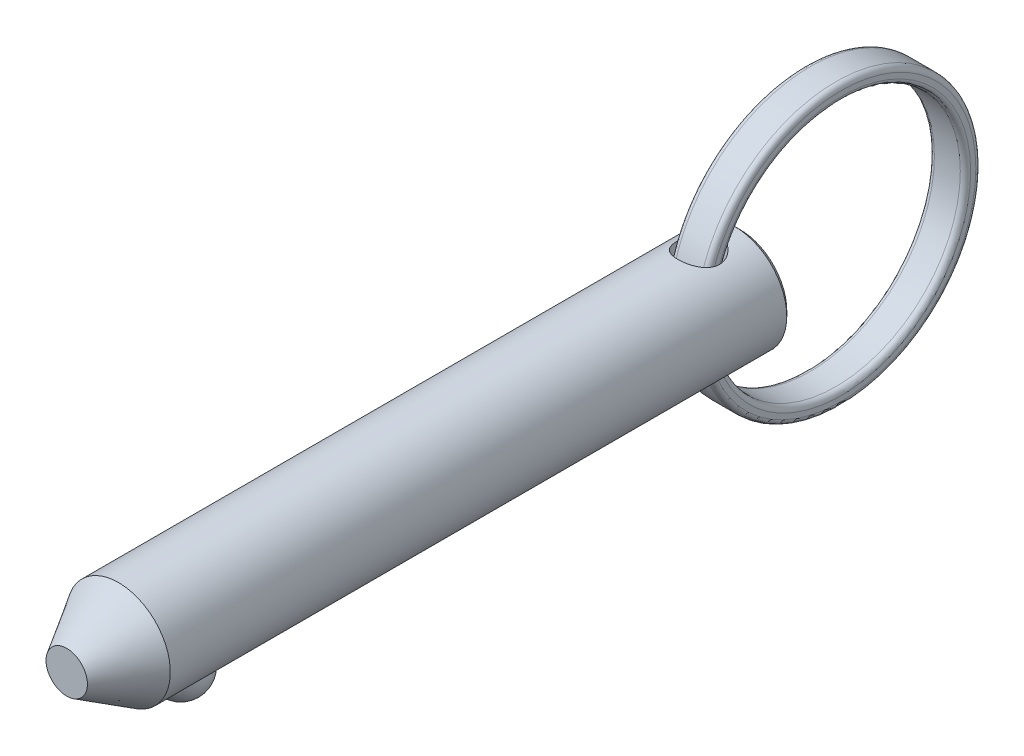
ISO-10303-21;
HEADER;
FILE_DESCRIPTION(('STEP AP214'),'2;1');
FILE_NAME('part.step','',(''),(''),'','','');
FILE_SCHEMA(('AUTOMOTIVE_DESIGN { 1 0 10303 214 1 1 1 1 }'));
ENDSEC;
DATA;
#1=APPLICATION_CONTEXT('core data for automotive mechanical design processes');
#2=APPLICATION_PROTOCOL_DEFINITION('international standard','automotive_design',2000,#1);
#3=PRODUCT_CONTEXT('',#1,'mechanical');
#4=PRODUCT('Part','Part','',(#3));
#5=PRODUCT_RELATED_PRODUCT_CATEGORY('part','',(#4));
#6=PRODUCT_DEFINITION_FORMATION('','',#4);
#7=PRODUCT_DEFINITION_CONTEXT('part definition',#1,'design');
#8=PRODUCT_DEFINITION('design','',#6,#7);
#9=PRODUCT_DEFINITION_SHAPE('','',#8);
#10=(LENGTH_UNIT() NAMED_UNIT(*) SI_UNIT(.MILLI.,.METRE.));
#11=(NAMED_UNIT(*) PLANE_ANGLE_UNIT() SI_UNIT($,.RADIAN.));
#12=(NAMED_UNIT(*) SI_UNIT($,.STERADIAN.) SOLID_ANGLE_UNIT());
#13=UNCERTAINTY_MEASURE_WITH_UNIT(LENGTH_MEASURE(1.E-05),#10,'distance_accuracy_value','');
#14=(GEOMETRIC_REPRESENTATION_CONTEXT(3) GLOBAL_UNCERTAINTY_ASSIGNED_CONTEXT((#13)) GLOBAL_UNIT_ASSIGNED_CONTEXT((#10,
#11,#12)) REPRESENTATION_CONTEXT('',''));
#15=CARTESIAN_POINT('',(0.,0.,0.));
#16=DIRECTION('',(0.,0.,1.));
#17=DIRECTION('',(1.,0.,0.));
#18=AXIS2_PLACEMENT_3D('',#15,#16,#17);
#19=CARTESIAN_POINT('',(0.,-5.,54.));
#20=DIRECTION('',(0.,0.,1.));
#21=DIRECTION('',(0.,1.,0.));
#22=AXIS2_PLACEMENT_3D('',#19,#20,#21);
#23=SPHERICAL_SURFACE('',#22,2.45);
#24=CARTESIAN_POINT('',(0.,-5.,56.45));
#25=VERTEX_POINT('',#24);
#26=VERTEX_LOOP('',#25);
#27=FACE_BOUND('',#26,.T.);
#28=ADVANCED_FACE('F41',(#27),#23,.T.);
#29=CLOSED_SHELL('',(#28));
#30=MANIFOLD_SOLID_BREP('B2',#29);
#31=CARTESIAN_POINT('',(0.,-32.5,4.));
#32=DIRECTION('',(0.,1.,0.));
#33=DIRECTION('',(0.,0.,1.));
#34=AXIS2_PLACEMENT_3D('',#31,#32,#33);
#35=CYLINDRICAL_SURFACE('',#34,2.);
#36=DIRECTION('',(0.,1.,0.));
#37=VECTOR('',#36,1.);
#38=CARTESIAN_POINT('',(1.75,-32.5,4.96824583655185));
#39=LINE('',#38,#37);
#40=CARTESIAN_POINT('',(1.75,-0.908074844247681,4.96824583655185));
#41=VERTEX_POINT('',#40);
#42=CARTESIAN_POINT('',(1.75,0.908074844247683,4.96824583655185));
#43=VERTEX_POINT('',#42);
#44=EDGE_CURVE('E100',#41,#43,#39,.T.);
#45=ORIENTED_EDGE('',*,*,#44,.T.);
#46=CARTESIAN_POINT('',(1.75,0.908074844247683,4.96824583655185));
#47=CARTESIAN_POINT('',(1.74999969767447,0.948151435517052,4.96824645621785));
#48=CARTESIAN_POINT('',(1.74997700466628,0.988227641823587,4.96828745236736));
#49=CARTESIAN_POINT('',(1.74985733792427,1.06838822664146,4.96850359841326));
#50=CARTESIAN_POINT('',(1.7497603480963,1.10847260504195,4.96867877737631));
#51=CARTESIAN_POINT('',(1.74931143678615,1.22932666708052,4.96948975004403));
#52=CARTESIAN_POINT('',(1.74880068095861,1.31009596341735,4.97041259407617));
#53=CARTESIAN_POINT('',(1.7473137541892,1.43417184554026,4.97308557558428));
#54=CARTESIAN_POINT('',(1.74666293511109,1.47749432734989,4.97425417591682));
#55=CARTESIAN_POINT('',(1.74495542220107,1.56413500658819,4.9773096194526));
#56=CARTESIAN_POINT('',(1.74389849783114,1.60745318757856,4.97919687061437));
#57=CARTESIAN_POINT('',(1.7411408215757,1.69383531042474,4.98409142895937));
#58=CARTESIAN_POINT('',(1.73944257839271,1.73689958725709,4.98709437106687));
#59=CARTESIAN_POINT('',(1.73497643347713,1.82279786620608,4.99492795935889));
#60=CARTESIAN_POINT('',(1.73220990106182,1.86563209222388,4.99975626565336));
#61=CARTESIAN_POINT('',(1.7264215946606,1.92866212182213,5.00969339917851));
#62=CARTESIAN_POINT('',(1.72426483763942,1.94915729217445,5.0133774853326));
#63=CARTESIAN_POINT('',(1.71909091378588,1.98975233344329,5.02213256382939));
#64=CARTESIAN_POINT('',(1.71607515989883,2.00985279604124,5.02720127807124));
#65=CARTESIAN_POINT('',(1.71033280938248,2.03924340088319,5.03671337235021));
#66=CARTESIAN_POINT('',(1.70820558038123,2.0489475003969,5.04021852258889));
#67=CARTESIAN_POINT('',(1.70334008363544,2.06779145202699,5.04816749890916));
#68=CARTESIAN_POINT('',(1.70060473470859,2.07693374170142,5.05260683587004));
#69=CARTESIAN_POINT('',(1.69598522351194,2.08920708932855,5.06001928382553));
#70=CARTESIAN_POINT('',(1.69448744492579,2.09282737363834,5.06241299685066));
#71=CARTESIAN_POINT('',(1.69126255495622,2.09972486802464,5.06753933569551));
#72=CARTESIAN_POINT('',(1.68953513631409,2.10300160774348,5.07027241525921));
#73=CARTESIAN_POINT('',(1.68578583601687,2.10908170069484,5.0761684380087));
#74=CARTESIAN_POINT('',(1.68375972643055,2.11187674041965,5.07933750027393));
#75=CARTESIAN_POINT('',(1.67942829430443,2.11666127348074,5.08606461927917));
#76=CARTESIAN_POINT('',(1.67712418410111,2.11865411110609,5.08962098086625));
#77=CARTESIAN_POINT('',(1.67297427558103,2.12118881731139,5.09597774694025));
#78=CARTESIAN_POINT('',(1.67117967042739,2.12198026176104,5.09871266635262));
#79=CARTESIAN_POINT('',(1.66752768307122,2.12298569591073,5.10424743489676));
#80=CARTESIAN_POINT('',(1.66567028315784,2.12319952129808,5.10704730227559));
#81=CARTESIAN_POINT('',(1.66195796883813,2.12307534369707,5.11261263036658));
#82=CARTESIAN_POINT('',(1.66010308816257,2.12274008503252,5.11537819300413));
#83=CARTESIAN_POINT('',(1.65642691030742,2.12159672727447,5.1208303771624));
#84=CARTESIAN_POINT('',(1.65460563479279,2.1207883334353,5.12351694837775));
#85=CARTESIAN_POINT('',(1.64974519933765,2.11807531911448,5.13065045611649));
#86=CARTESIAN_POINT('',(1.64676014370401,2.11579991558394,5.13499190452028));
#87=CARTESIAN_POINT('',(1.64098420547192,2.11049083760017,5.14332701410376));
#88=CARTESIAN_POINT('',(1.63819405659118,2.10745447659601,5.14731937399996));
#89=CARTESIAN_POINT('',(1.62880374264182,2.09604260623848,5.16066132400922));
#90=CARTESIAN_POINT('',(1.62265697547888,2.08640017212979,5.1692228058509));
#91=CARTESIAN_POINT('',(1.61107908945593,2.06578123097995,5.18512445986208));
#92=CARTESIAN_POINT('',(1.60565261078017,2.05479687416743,5.19245678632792));
#93=CARTESIAN_POINT('',(1.59185947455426,2.02453057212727,5.21086398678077));
#94=CARTESIAN_POINT('',(1.58393790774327,2.00458915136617,5.22118429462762));
#95=CARTESIAN_POINT('',(1.5689613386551,1.96369056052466,5.24036528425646));
#96=CARTESIAN_POINT('',(1.56190858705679,1.9427309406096,5.24922219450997));
#97=CARTESIAN_POINT('',(1.54843638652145,1.90014993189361,5.26588300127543));
#98=CARTESIAN_POINT('',(1.54201816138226,1.87852736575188,5.2736848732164));
#99=CARTESIAN_POINT('',(1.52970252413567,1.83489038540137,5.28844939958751));
#100=CARTESIAN_POINT('',(1.52380447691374,1.81287648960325,5.29541308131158));
#101=CARTESIAN_POINT('',(1.50749979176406,1.74931085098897,5.31442481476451));
#102=CARTESIAN_POINT('',(1.49762022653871,1.70737562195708,5.32564340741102));
#103=CARTESIAN_POINT('',(1.47902501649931,1.62282145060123,5.34635642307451));
#104=CARTESIAN_POINT('',(1.47030992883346,1.58020219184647,5.3558500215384));
#105=CARTESIAN_POINT('',(1.44562168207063,1.45148606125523,5.38230596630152));
#106=CARTESIAN_POINT('',(1.43114111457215,1.36467697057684,5.39720318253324));
#107=CARTESIAN_POINT('',(1.40539336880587,1.18979781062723,5.4230932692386));
#108=CARTESIAN_POINT('',(1.39413522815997,1.10172490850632,5.4340751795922));
#109=CARTESIAN_POINT('',(1.37452808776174,0.925021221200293,5.45287882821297));
#110=CARTESIAN_POINT('',(1.36617603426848,0.836391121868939,5.46070388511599));
#111=CARTESIAN_POINT('',(1.35212966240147,0.658669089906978,5.47371499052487));
#112=CARTESIAN_POINT('',(1.34643729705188,0.569576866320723,5.47889910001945));
#113=CARTESIAN_POINT('',(1.33757937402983,0.391151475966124,5.48691520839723));
#114=CARTESIAN_POINT('',(1.33441416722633,0.301818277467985,5.48974688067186));
#115=CARTESIAN_POINT('',(1.33053481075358,0.122918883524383,5.4932125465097));
#116=CARTESIAN_POINT('',(1.32982446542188,0.0333525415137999,5.49384312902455));
#117=CARTESIAN_POINT('',(1.33084912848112,-0.145755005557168,5.49293038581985));
#118=CARTESIAN_POINT('',(1.33258412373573,-0.235296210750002,5.49138707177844));
#119=CARTESIAN_POINT('',(1.33853158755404,-0.413990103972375,5.48605156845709));
#120=CARTESIAN_POINT('',(1.34273739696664,-0.503143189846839,5.48226542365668));
#121=CARTESIAN_POINT('',(1.35371966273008,-0.681142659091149,5.47224288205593));
#122=CARTESIAN_POINT('',(1.36049568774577,-0.769989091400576,5.46600689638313));
#123=CARTESIAN_POINT('',(1.37677700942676,-0.947032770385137,5.45072726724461));
#124=CARTESIAN_POINT('',(1.38627742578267,-1.03523089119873,5.44168864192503));
#125=CARTESIAN_POINT('',(1.40828029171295,-1.21082019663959,5.42020708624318));
#126=CARTESIAN_POINT('',(1.42078139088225,-1.29821172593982,5.40776568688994));
#127=CARTESIAN_POINT('',(1.44206700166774,-1.42780066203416,5.38583625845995));
#128=CARTESIAN_POINT('',(1.44953381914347,-1.47050274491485,5.37803663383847));
#129=CARTESIAN_POINT('',(1.46542518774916,-1.55549399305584,5.3611263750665));
#130=CARTESIAN_POINT('',(1.47385017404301,-1.59778296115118,5.35201514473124));
#131=CARTESIAN_POINT('',(1.49177755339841,-1.68161314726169,5.3322076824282));
#132=CARTESIAN_POINT('',(1.5012764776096,-1.72315629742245,5.32151652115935));
#133=CARTESIAN_POINT('',(1.52161486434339,-1.80530471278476,5.29804984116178));
#134=CARTESIAN_POINT('',(1.53245302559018,-1.84591084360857,5.28527634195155));
#135=CARTESIAN_POINT('',(1.55192503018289,-1.91164416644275,5.26161511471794));
#136=CARTESIAN_POINT('',(1.56001770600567,-1.93725068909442,5.25161245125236));
#137=CARTESIAN_POINT('',(1.57734211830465,-1.98737059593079,5.22971246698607));
#138=CARTESIAN_POINT('',(1.58657550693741,-2.0118823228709,5.21781239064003));
#139=CARTESIAN_POINT('',(1.60186020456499,-2.04675067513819,5.19754508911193));
#140=CARTESIAN_POINT('',(1.60721492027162,-2.05809226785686,5.19035780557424));
#141=CARTESIAN_POINT('',(1.61859482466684,-2.07956555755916,5.17483805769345));
#142=CARTESIAN_POINT('',(1.62461547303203,-2.08970457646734,5.16651326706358));
#143=CARTESIAN_POINT('',(1.63331395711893,-2.10151305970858,5.15425263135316));
#144=CARTESIAN_POINT('',(1.63553788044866,-2.10431553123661,5.15110019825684));
#145=CARTESIAN_POINT('',(1.64012059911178,-2.10952960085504,5.14456125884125));
#146=CARTESIAN_POINT('',(1.64247959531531,-2.11194059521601,5.14117440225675));
#147=CARTESIAN_POINT('',(1.64736493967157,-2.11623877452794,5.13411084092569));
#148=CARTESIAN_POINT('',(1.64989295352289,-2.11811934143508,5.13043115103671));
#149=CARTESIAN_POINT('',(1.65506807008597,-2.12108002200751,5.12284038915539));
#150=CARTESIAN_POINT('',(1.6577147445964,-2.12216280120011,5.11893013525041));
#151=CARTESIAN_POINT('',(1.6622530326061,-2.1231093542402,5.11217182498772));
#152=CARTESIAN_POINT('',(1.66413426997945,-2.123240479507,5.10935501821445));
#153=CARTESIAN_POINT('',(1.66786725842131,-2.12292459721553,5.10373463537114));
#154=CARTESIAN_POINT('',(1.66971903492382,-2.12247811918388,5.1009310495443));
#155=CARTESIAN_POINT('',(1.67333773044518,-2.12100680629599,5.09542308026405));
#156=CARTESIAN_POINT('',(1.67510464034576,-2.11998190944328,5.09271870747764));
#157=CARTESIAN_POINT('',(1.67851136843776,-2.1174183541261,5.08747845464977));
#158=CARTESIAN_POINT('',(1.68015103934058,-2.11587911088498,5.08494277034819));
#159=CARTESIAN_POINT('',(1.68391525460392,-2.11168041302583,5.0790949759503));
#160=CARTESIAN_POINT('',(1.68596834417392,-2.10881958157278,5.07588263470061));
#161=CARTESIAN_POINT('',(1.68979484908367,-2.10254261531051,5.06986265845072));
#162=CARTESIAN_POINT('',(1.69156755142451,-2.09912510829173,5.06705605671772));
#163=CARTESIAN_POINT('',(1.69627720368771,-2.08888435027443,5.05956456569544));
#164=CARTESIAN_POINT('',(1.69892882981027,-2.08162778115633,5.05530176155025));
#165=CARTESIAN_POINT('',(1.70367900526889,-2.06652135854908,5.04761524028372));
#166=CARTESIAN_POINT('',(1.70577562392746,-2.05866955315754,5.04419445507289));
#167=CARTESIAN_POINT('',(1.71172442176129,-2.03369576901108,5.03443784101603));
#168=CARTESIAN_POINT('',(1.7149167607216,-2.01602938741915,5.02912185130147));
#169=CARTESIAN_POINT('',(1.72041428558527,-1.98018381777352,5.01990244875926));
#170=CARTESIAN_POINT('',(1.72271591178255,-1.96200287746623,5.01600470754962));
#171=CARTESIAN_POINT('',(1.72676732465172,-1.92524813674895,5.00910403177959));
#172=CARTESIAN_POINT('',(1.72851223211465,-1.90667230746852,5.0061090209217));
#173=CARTESIAN_POINT('',(1.73160673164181,-1.86943891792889,5.00077332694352));
#174=CARTESIAN_POINT('',(1.73295711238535,-1.85078159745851,4.99843133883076));
#175=CARTESIAN_POINT('',(1.73654596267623,-1.79542287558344,4.99218532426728));
#176=CARTESIAN_POINT('',(1.73838976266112,-1.75862216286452,4.98894480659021));
#177=CARTESIAN_POINT('',(1.74145351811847,-1.68491310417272,4.9835385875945));
#178=CARTESIAN_POINT('',(1.7426732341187,-1.64800472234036,4.9813732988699));
#179=CARTESIAN_POINT('',(1.74573789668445,-1.53709375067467,4.97591914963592));
#180=CARTESIAN_POINT('',(1.746982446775,-1.46302511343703,4.97368245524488));
#181=CARTESIAN_POINT('',(1.74872354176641,-1.31530858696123,4.97054995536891));
#182=CARTESIAN_POINT('',(1.74922451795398,-1.24166083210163,4.96964620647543));
#183=CARTESIAN_POINT('',(1.7498436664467,-1.09441559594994,4.96852866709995));
#184=CARTESIAN_POINT('',(1.74996213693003,-1.02081812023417,4.96831433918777));
#185=CARTESIAN_POINT('',(1.75002355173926,-0.870063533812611,4.968203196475));
#186=CARTESIAN_POINT('',(1.74995772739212,-0.792906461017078,4.96832224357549));
#187=CARTESIAN_POINT('',(1.74976526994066,-0.638572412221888,4.96866999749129));
#188=CARTESIAN_POINT('',(1.74963862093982,-0.561395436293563,4.96889873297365));
#189=CARTESIAN_POINT('',(1.74940525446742,-0.406767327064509,4.96932002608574));
#190=CARTESIAN_POINT('',(1.74929860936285,-0.329316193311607,4.96951245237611));
#191=CARTESIAN_POINT('',(1.74914315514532,-0.174433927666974,4.96979289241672));
#192=CARTESIAN_POINT('',(1.74909433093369,-0.0970027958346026,4.9698809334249));
#193=CARTESIAN_POINT('',(1.74909304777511,-0.0195715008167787,4.9698832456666));
#194=B_SPLINE_CURVE_WITH_KNOTS('',3,(#46,#47,#48,#49,#50,#51,#52,#53,#54,#55,#56,#57,#58,#59,
#60,#61,#62,#63,#64,#65,#66,#67,#68,#69,#70,#71,#72,#73,#74,#75,#76,#77,#78,#79,#80,#81,#82,#83,
#84,#85,#86,#87,#88,#89,#90,#91,#92,#93,#94,#95,#96,#97,#98,#99,#100,#101,#102,#103,#104,#105,
#106,#107,#108,#109,#110,#111,#112,#113,#114,#115,#116,#117,#118,#119,#120,#121,#122,#123,#124,
#125,#126,#127,#128,#129,#130,#131,#132,#133,#134,#135,#136,#137,#138,#139,#140,#141,#142,#143,
#144,#145,#146,#147,#148,#149,#150,#151,#152,#153,#154,#155,#156,#157,#158,#159,#160,#161,#162,
#163,#164,#165,#166,#167,#168,#169,#170,#171,#172,#173,#174,#175,#176,#177,#178,#179,#180,#181,
#182,#183,#184,#185,#186,#187,#188,#189,#190,#191,#192,#193),.UNSPECIFIED.,.F.,.F.,(4,2,2,2,2,2,
2,2,2,2,2,2,2,2,2,2,2,2,2,2,2,2,2,2,2,2,2,2,2,2,2,2,2,2,2,2,2,2,2,2,2,2,2,2,2,2,2,2,2,2,2,2,2,2,
2,2,2,2,2,2,2,2,2,2,2,2,2,2,2,2,2,2,2,4),(0.,0.120228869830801,0.240483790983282,
0.482797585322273,0.612823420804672,0.742923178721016,0.872519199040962,1.00194965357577,
1.06473117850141,1.12741002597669,1.15898008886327,1.1904017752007,1.20415307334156,
1.21792295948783,1.23191079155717,1.24583969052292,1.25588734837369,1.26593786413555,
1.2759383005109,1.2859449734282,1.30306147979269,1.32023928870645,1.362765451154,
1.40555349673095,1.47680144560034,1.54823024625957,1.61979422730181,1.69126958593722,
1.82474560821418,1.95828526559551,2.225830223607,2.49411834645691,2.76212369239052,
3.03032552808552,3.29856459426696,3.56721916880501,3.8358723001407,4.10380467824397,
4.3716921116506,4.63910263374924,4.90639303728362,5.03850764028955,5.17068248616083,
5.30244198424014,5.43407444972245,5.5200043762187,5.60606025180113,5.64938431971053,
5.69242935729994,5.70671707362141,5.72102661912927,5.73550751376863,5.74993980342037,
5.7600651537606,5.77018122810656,5.78029838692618,5.79042708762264,5.8046444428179,
5.81889738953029,5.84522017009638,5.87163334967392,5.92759395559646,5.98377595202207,
6.04043761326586,6.09698521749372,6.2079087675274,6.31887484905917,6.54116777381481,
6.76213056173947,6.98292105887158,7.21439271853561,7.4459249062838,7.67827918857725,
7.91057278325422),.UNSPECIFIED.);
#195=EDGE_CURVE('E39',#43,#41,#194,.T.);
#196=ORIENTED_EDGE('',*,*,#195,.T.);
#197=EDGE_LOOP('',(#45,#196));
#198=FACE_BOUND('',#197,.T.);
#199=CARTESIAN_POINT('',(0.,-5.,6.));
#200=CARTESIAN_POINT('',(0.107493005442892,-4.99999271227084,5.99999014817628));
#201=CARTESIAN_POINT('',(0.215172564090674,-4.99649294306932,5.99128224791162));
#202=CARTESIAN_POINT('',(0.427496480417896,-4.98283453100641,5.95675229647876));
#203=CARTESIAN_POINT('',(0.532131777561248,-4.97265778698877,5.93088372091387));
#204=CARTESIAN_POINT('',(0.734953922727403,-4.94674209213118,5.86312392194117));
#205=CARTESIAN_POINT('',(0.833160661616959,-4.93102136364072,5.82128515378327));
#206=CARTESIAN_POINT('',(1.02107197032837,-4.89556610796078,5.72298082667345));
#207=CARTESIAN_POINT('',(1.11077947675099,-4.87583297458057,5.66652034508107));
#208=CARTESIAN_POINT('',(1.28350100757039,-4.83330886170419,5.53776450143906));
#209=CARTESIAN_POINT('',(1.36606227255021,-4.8104229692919,5.46489334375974));
#210=CARTESIAN_POINT('',(1.51817500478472,-4.76460576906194,5.30659999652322));
#211=CARTESIAN_POINT('',(1.58772010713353,-4.74167444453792,5.22117170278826));
#212=CARTESIAN_POINT('',(1.71487456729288,-4.69722791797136,5.03557192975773));
#213=CARTESIAN_POINT('',(1.77181498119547,-4.67582115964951,4.9349135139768));
#214=CARTESIAN_POINT('',(1.86775471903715,-4.63833647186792,4.72446360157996));
#215=CARTESIAN_POINT('',(1.90676256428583,-4.62225601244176,4.61467647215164));
#216=CARTESIAN_POINT('',(1.96389882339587,-4.59826357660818,4.3942876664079));
#217=CARTESIAN_POINT('',(1.98289396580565,-4.59001420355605,4.28394876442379));
#218=CARTESIAN_POINT('',(2.00217296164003,-4.58164004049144,4.06136500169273));
#219=CARTESIAN_POINT('',(2.00246601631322,-4.58151125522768,3.94912110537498));
#220=CARTESIAN_POINT('',(1.98498936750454,-4.58910500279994,3.73424332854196));
#221=CARTESIAN_POINT('',(1.96847531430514,-4.5962817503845,3.63148428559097));
#222=CARTESIAN_POINT('',(1.91994688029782,-4.61676187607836,3.43034044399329));
#223=CARTESIAN_POINT('',(1.88792979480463,-4.63006632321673,3.33195641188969));
#224=CARTESIAN_POINT('',(1.80869473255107,-4.6615948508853,3.13998216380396));
#225=CARTESIAN_POINT('',(1.76117986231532,-4.67991379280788,3.04653076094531));
#226=CARTESIAN_POINT('',(1.65250646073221,-4.7193811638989,2.86858418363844));
#227=CARTESIAN_POINT('',(1.59134280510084,-4.74053065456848,2.78409239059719));
#228=CARTESIAN_POINT('',(1.45155059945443,-4.78526736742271,2.619590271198));
#229=CARTESIAN_POINT('',(1.37193746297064,-4.80891664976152,2.54043127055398));
#230=CARTESIAN_POINT('',(1.20031442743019,-4.85459824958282,2.39631552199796));
#231=CARTESIAN_POINT('',(1.10830206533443,-4.87663024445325,2.33136160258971));
#232=CARTESIAN_POINT('',(0.912077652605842,-4.91714681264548,2.21638255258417));
#233=CARTESIAN_POINT('',(0.807660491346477,-4.93555270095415,2.16667771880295));
#234=CARTESIAN_POINT('',(0.591023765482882,-4.96614828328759,2.08583213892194));
#235=CARTESIAN_POINT('',(0.478808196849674,-4.97834113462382,2.05468196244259));
#236=CARTESIAN_POINT('',(0.25689588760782,-4.9945613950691,2.0135517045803));
#237=CARTESIAN_POINT('',(0.147443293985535,-4.99902945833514,2.00242754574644));
#238=CARTESIAN_POINT('',(-0.0718453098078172,-5.00068478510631,1.99828689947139));
#239=CARTESIAN_POINT('',(-0.181681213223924,-4.99787393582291,2.00526571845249));
#240=CARTESIAN_POINT('',(-0.393432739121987,-4.98557567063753,2.03629175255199));
#241=CARTESIAN_POINT('',(-0.495482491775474,-4.97639391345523,2.05955798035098));
#242=CARTESIAN_POINT('',(-0.69413542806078,-4.952594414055,2.12143570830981));
#243=CARTESIAN_POINT('',(-0.790737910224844,-4.9379759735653,2.16004917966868));
#244=CARTESIAN_POINT('',(-0.979078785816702,-4.90416594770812,2.25278493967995));
#245=CARTESIAN_POINT('',(-1.07057802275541,-4.88484815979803,2.30734547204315));
#246=CARTESIAN_POINT('',(-1.24344359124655,-4.84373364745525,2.42994032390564));
#247=CARTESIAN_POINT('',(-1.32480584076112,-4.8219359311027,2.49798004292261));
#248=CARTESIAN_POINT('',(-1.48072304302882,-4.77645117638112,2.65087001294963));
#249=CARTESIAN_POINT('',(-1.55447393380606,-4.75273441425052,2.73653354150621));
#250=CARTESIAN_POINT('',(-1.68675119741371,-4.70741672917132,2.91944008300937));
#251=CARTESIAN_POINT('',(-1.74527506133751,-4.68581615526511,3.01668500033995));
#252=CARTESIAN_POINT('',(-1.84580750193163,-4.64714299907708,3.22146169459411));
#253=CARTESIAN_POINT('',(-1.88765059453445,-4.63011630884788,3.32908399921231));
#254=CARTESIAN_POINT('',(-1.9522962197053,-4.60323673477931,3.55073365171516));
#255=CARTESIAN_POINT('',(-1.97511280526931,-4.59337855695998,3.66475620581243));
#256=CARTESIAN_POINT('',(-1.9997156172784,-4.58271759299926,3.88712790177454));
#257=CARTESIAN_POINT('',(-2.00289708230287,-4.58131421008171,3.99529483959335));
#258=CARTESIAN_POINT('',(-1.99180315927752,-4.58614836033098,4.21054485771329));
#259=CARTESIAN_POINT('',(-1.97752998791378,-4.59238492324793,4.31762807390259));
#260=CARTESIAN_POINT('',(-1.93307136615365,-4.61126649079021,4.52333218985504));
#261=CARTESIAN_POINT('',(-1.90353749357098,-4.62364831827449,4.622120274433));
#262=CARTESIAN_POINT('',(-1.83000544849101,-4.65324001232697,4.81337862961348));
#263=CARTESIAN_POINT('',(-1.78600328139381,-4.67045121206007,4.90584714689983));
#264=CARTESIAN_POINT('',(-1.68187276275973,-4.70898609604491,5.08760961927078));
#265=CARTESIAN_POINT('',(-1.62096533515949,-4.73048882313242,5.17641867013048));
#266=CARTESIAN_POINT('',(-1.4858921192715,-4.77463804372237,5.34299331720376));
#267=CARTESIAN_POINT('',(-1.41172233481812,-4.79728488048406,5.42075557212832));
#268=CARTESIAN_POINT('',(-1.24650550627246,-4.84293567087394,5.56820285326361));
#269=CARTESIAN_POINT('',(-1.15467600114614,-4.86586757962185,5.63703730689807));
#270=CARTESIAN_POINT('',(-0.959900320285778,-4.90800406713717,5.75833704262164));
#271=CARTESIAN_POINT('',(-0.856949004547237,-4.92720691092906,5.81079471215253));
#272=CARTESIAN_POINT('',(-0.644738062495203,-4.95939714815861,5.89662221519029));
#273=CARTESIAN_POINT('',(-0.535631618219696,-4.97249363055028,5.93032932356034));
#274=CARTESIAN_POINT('',(-0.312876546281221,-4.99144306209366,5.97863912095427));
#275=CARTESIAN_POINT('',(-0.199243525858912,-4.99731899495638,5.9933024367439));
#276=CARTESIAN_POINT('',(-0.0569122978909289,-4.99975899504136,5.99939538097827));
#277=CARTESIAN_POINT('',(-0.0284626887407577,-5.00000192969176,6.00000260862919));
#278=CARTESIAN_POINT('',(0.,-5.,6.));
#279=B_SPLINE_CURVE_WITH_KNOTS('',3,(#199,#200,#201,#202,#203,#204,#205,#206,#207,#208,#209,
#210,#211,#212,#213,#214,#215,#216,#217,#218,#219,#220,#221,#222,#223,#224,#225,#226,#227,#228,
#229,#230,#231,#232,#233,#234,#235,#236,#237,#238,#239,#240,#241,#242,#243,#244,#245,#246,#247,
#248,#249,#250,#251,#252,#253,#254,#255,#256,#257,#258,#259,#260,#261,#262,#263,#264,#265,#266,
#267,#268,#269,#270,#271,#272,#273,#274,#275,#276,#277,#278),.UNSPECIFIED.,.T.,.F.,(4,2,2,2,2,2,
2,2,2,2,2,2,2,2,2,2,2,2,2,2,2,2,2,2,2,2,2,2,2,2,2,2,2,2,2,2,2,2,2,4),(0.,0.322402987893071,
0.645683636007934,0.967911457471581,1.29002753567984,1.62597381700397,1.96208394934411,
2.31315258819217,2.66405423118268,2.99904105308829,3.33386306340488,3.64538328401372,
3.95695787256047,4.27489126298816,4.59294421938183,4.93558349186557,5.27829092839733,
5.62776913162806,5.9770695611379,6.30569184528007,6.63422893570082,6.94800455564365,
7.26182048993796,7.58523513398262,7.90877959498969,8.25368474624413,8.59864669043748,
8.94695045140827,9.29499672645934,9.61799673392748,9.94095572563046,10.2511431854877,
10.5614163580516,10.8894546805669,11.2175920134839,11.5670042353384,11.9165786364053,
12.2596430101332,12.6016125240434,12.686980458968),.UNSPECIFIED.);
#280=CARTESIAN_POINT('',(0.,-5.,6.));
#281=VERTEX_POINT('',#280);
#282=EDGE_CURVE('E162',#281,#281,#279,.T.);
#283=ORIENTED_EDGE('',*,*,#282,.F.);
#284=EDGE_LOOP('',(#283));
#285=FACE_BOUND('',#284,.T.);
#286=CARTESIAN_POINT('',(0.,5.,6.));
#287=CARTESIAN_POINT('',(-0.107493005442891,4.99999271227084,5.99999014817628));
#288=CARTESIAN_POINT('',(-0.215172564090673,4.99649294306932,5.99128224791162));
#289=CARTESIAN_POINT('',(-0.427496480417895,4.98283453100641,5.95675229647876));
#290=CARTESIAN_POINT('',(-0.532131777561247,4.97265778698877,5.93088372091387));
#291=CARTESIAN_POINT('',(-0.734953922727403,4.94674209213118,5.86312392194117));
#292=CARTESIAN_POINT('',(-0.833160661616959,4.93102136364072,5.82128515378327));
#293=CARTESIAN_POINT('',(-1.02107197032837,4.89556610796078,5.72298082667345));
#294=CARTESIAN_POINT('',(-1.11077947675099,4.87583297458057,5.66652034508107));
#295=CARTESIAN_POINT('',(-1.28350100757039,4.83330886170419,5.53776450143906));
#296=CARTESIAN_POINT('',(-1.36606227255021,4.8104229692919,5.46489334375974));
#297=CARTESIAN_POINT('',(-1.51817500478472,4.76460576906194,5.30659999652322));
#298=CARTESIAN_POINT('',(-1.58772010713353,4.74167444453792,5.22117170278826));
#299=CARTESIAN_POINT('',(-1.71487456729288,4.69722791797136,5.03557192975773));
#300=CARTESIAN_POINT('',(-1.77181498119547,4.67582115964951,4.9349135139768));
#301=CARTESIAN_POINT('',(-1.86775471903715,4.63833647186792,4.72446360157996));
#302=CARTESIAN_POINT('',(-1.90676256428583,4.62225601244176,4.61467647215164));
#303=CARTESIAN_POINT('',(-1.96389882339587,4.59826357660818,4.3942876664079));
#304=CARTESIAN_POINT('',(-1.98289396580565,4.59001420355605,4.28394876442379));
#305=CARTESIAN_POINT('',(-2.00217296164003,4.58164004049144,4.06136500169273));
#306=CARTESIAN_POINT('',(-2.00246601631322,4.58151125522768,3.94912110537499));
#307=CARTESIAN_POINT('',(-1.98498936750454,4.58910500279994,3.73424332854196));
#308=CARTESIAN_POINT('',(-1.96847531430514,4.5962817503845,3.63148428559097));
#309=CARTESIAN_POINT('',(-1.91994688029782,4.61676187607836,3.43034044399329));
#310=CARTESIAN_POINT('',(-1.88792979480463,4.63006632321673,3.33195641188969));
#311=CARTESIAN_POINT('',(-1.80869473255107,4.6615948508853,3.13998216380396));
#312=CARTESIAN_POINT('',(-1.76117986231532,4.67991379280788,3.04653076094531));
#313=CARTESIAN_POINT('',(-1.65250646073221,4.7193811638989,2.86858418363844));
#314=CARTESIAN_POINT('',(-1.59134280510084,4.74053065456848,2.78409239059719));
#315=CARTESIAN_POINT('',(-1.45155059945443,4.78526736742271,2.619590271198));
#316=CARTESIAN_POINT('',(-1.37193746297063,4.80891664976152,2.54043127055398));
#317=CARTESIAN_POINT('',(-1.20031442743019,4.85459824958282,2.39631552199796));
#318=CARTESIAN_POINT('',(-1.10830206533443,4.87663024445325,2.33136160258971));
#319=CARTESIAN_POINT('',(-0.912077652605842,4.91714681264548,2.21638255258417));
#320=CARTESIAN_POINT('',(-0.807660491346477,4.93555270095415,2.16667771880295));
#321=CARTESIAN_POINT('',(-0.591023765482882,4.96614828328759,2.08583213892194));
#322=CARTESIAN_POINT('',(-0.478808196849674,4.97834113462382,2.05468196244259));
#323=CARTESIAN_POINT('',(-0.25689588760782,4.9945613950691,2.0135517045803));
#324=CARTESIAN_POINT('',(-0.147443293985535,4.99902945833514,2.00242754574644));
#325=CARTESIAN_POINT('',(0.0718453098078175,5.00068478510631,1.99828689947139));
#326=CARTESIAN_POINT('',(0.181681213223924,4.99787393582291,2.00526571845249));
#327=CARTESIAN_POINT('',(0.393432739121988,4.98557567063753,2.03629175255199));
#328=CARTESIAN_POINT('',(0.495482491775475,4.97639391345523,2.05955798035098));
#329=CARTESIAN_POINT('',(0.694135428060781,4.952594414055,2.12143570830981));
#330=CARTESIAN_POINT('',(0.790737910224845,4.9379759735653,2.16004917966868));
#331=CARTESIAN_POINT('',(0.979078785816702,4.90416594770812,2.25278493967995));
#332=CARTESIAN_POINT('',(1.07057802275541,4.88484815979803,2.30734547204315));
#333=CARTESIAN_POINT('',(1.24344359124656,4.84373364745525,2.42994032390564));
#334=CARTESIAN_POINT('',(1.32480584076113,4.8219359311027,2.49798004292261));
#335=CARTESIAN_POINT('',(1.48072304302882,4.77645117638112,2.65087001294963));
#336=CARTESIAN_POINT('',(1.55447393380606,4.75273441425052,2.73653354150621));
#337=CARTESIAN_POINT('',(1.68675119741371,4.70741672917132,2.91944008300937));
#338=CARTESIAN_POINT('',(1.74527506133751,4.68581615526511,3.01668500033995));
#339=CARTESIAN_POINT('',(1.84580750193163,4.64714299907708,3.22146169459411));
#340=CARTESIAN_POINT('',(1.88765059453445,4.63011630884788,3.32908399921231));
#341=CARTESIAN_POINT('',(1.9522962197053,4.60323673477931,3.55073365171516));
#342=CARTESIAN_POINT('',(1.97511280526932,4.59337855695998,3.66475620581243));
#343=CARTESIAN_POINT('',(1.9997156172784,4.58271759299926,3.88712790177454));
#344=CARTESIAN_POINT('',(2.00289708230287,4.58131421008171,3.99529483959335));
#345=CARTESIAN_POINT('',(1.99180315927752,4.58614836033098,4.21054485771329));
#346=CARTESIAN_POINT('',(1.97752998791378,4.59238492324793,4.31762807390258));
#347=CARTESIAN_POINT('',(1.93307136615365,4.61126649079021,4.52333218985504));
#348=CARTESIAN_POINT('',(1.90353749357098,4.62364831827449,4.622120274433));
#349=CARTESIAN_POINT('',(1.83000544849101,4.65324001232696,4.81337862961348));
#350=CARTESIAN_POINT('',(1.78600328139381,4.67045121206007,4.90584714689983));
#351=CARTESIAN_POINT('',(1.68187276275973,4.70898609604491,5.08760961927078));
#352=CARTESIAN_POINT('',(1.62096533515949,4.73048882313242,5.17641867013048));
#353=CARTESIAN_POINT('',(1.4858921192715,4.77463804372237,5.34299331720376));
#354=CARTESIAN_POINT('',(1.41172233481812,4.79728488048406,5.42075557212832));
#355=CARTESIAN_POINT('',(1.24650550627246,4.84293567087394,5.56820285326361));
#356=CARTESIAN_POINT('',(1.15467600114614,4.86586757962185,5.63703730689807));
#357=CARTESIAN_POINT('',(0.959900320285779,4.90800406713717,5.75833704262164));
#358=CARTESIAN_POINT('',(0.856949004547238,4.92720691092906,5.81079471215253));
#359=CARTESIAN_POINT('',(0.644738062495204,4.95939714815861,5.89662221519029));
#360=CARTESIAN_POINT('',(0.535631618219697,4.97249363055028,5.93032932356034));
#361=CARTESIAN_POINT('',(0.312876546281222,4.99144306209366,5.97863912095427));
#362=CARTESIAN_POINT('',(0.199243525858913,4.99731899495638,5.9933024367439));
#363=CARTESIAN_POINT('',(0.0569122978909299,4.99975899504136,5.99939538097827));
#364=CARTESIAN_POINT('',(0.0284626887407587,5.00000192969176,6.00000260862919));
#365=CARTESIAN_POINT('',(0.,5.,6.));
#366=B_SPLINE_CURVE_WITH_KNOTS('',3,(#286,#287,#288,#289,#290,#291,#292,#293,#294,#295,#296,
#297,#298,#299,#300,#301,#302,#303,#304,#305,#306,#307,#308,#309,#310,#311,#312,#313,#314,#315,
#316,#317,#318,#319,#320,#321,#322,#323,#324,#325,#326,#327,#328,#329,#330,#331,#332,#333,#334,
#335,#336,#337,#338,#339,#340,#341,#342,#343,#344,#345,#346,#347,#348,#349,#350,#351,#352,#353,
#354,#355,#356,#357,#358,#359,#360,#361,#362,#363,#364,#365),.UNSPECIFIED.,.T.,.F.,(4,2,2,2,2,2,
2,2,2,2,2,2,2,2,2,2,2,2,2,2,2,2,2,2,2,2,2,2,2,2,2,2,2,2,2,2,2,2,2,4),(0.,0.322402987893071,
0.645683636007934,0.967911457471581,1.29002753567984,1.62597381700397,1.96208394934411,
2.31315258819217,2.66405423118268,2.99904105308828,3.33386306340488,3.64538328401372,
3.95695787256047,4.27489126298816,4.59294421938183,4.93558349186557,5.27829092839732,
5.62776913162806,5.9770695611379,6.30569184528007,6.63422893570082,6.94800455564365,
7.26182048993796,7.58523513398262,7.90877959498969,8.25368474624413,8.59864669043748,
8.94695045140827,9.29499672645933,9.61799673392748,9.94095572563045,10.2511431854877,
10.5614163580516,10.8894546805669,11.2175920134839,11.5670042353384,11.9165786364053,
12.2596430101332,12.6016125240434,12.6869804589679),.UNSPECIFIED.);
#367=CARTESIAN_POINT('',(0.,5.,6.));
#368=VERTEX_POINT('',#367);
#369=EDGE_CURVE('E165',#368,#368,#366,.T.);
#370=ORIENTED_EDGE('',*,*,#369,.F.);
#371=EDGE_LOOP('',(#370));
#372=FACE_BOUND('',#371,.T.);
#373=DIRECTION('',(0.,1.,0.));
#374=VECTOR('',#373,1.);
#375=CARTESIAN_POINT('',(-1.75,-32.5,4.96824583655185));
#376=LINE('',#375,#374);
#377=CARTESIAN_POINT('',(-1.75,-0.908074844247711,4.96824583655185));
#378=VERTEX_POINT('',#377);
#379=CARTESIAN_POINT('',(-1.75,0.908074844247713,4.96824583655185));
#380=VERTEX_POINT('',#379);
#381=EDGE_CURVE('E98',#378,#380,#376,.T.);
#382=ORIENTED_EDGE('',*,*,#381,.F.);
#383=CARTESIAN_POINT('',(-1.75,-0.908074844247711,4.96824583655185));
#384=CARTESIAN_POINT('',(-1.74999969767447,-0.948151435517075,4.96824645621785));
#385=CARTESIAN_POINT('',(-1.74997700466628,-0.988227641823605,4.96828745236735));
#386=CARTESIAN_POINT('',(-1.74985733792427,-1.06838822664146,4.96850359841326));
#387=CARTESIAN_POINT('',(-1.7497603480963,-1.10847260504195,4.96867877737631));
#388=CARTESIAN_POINT('',(-1.74931143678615,-1.22932666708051,4.96948975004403));
#389=CARTESIAN_POINT('',(-1.74880068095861,-1.31009596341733,4.97041259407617));
#390=CARTESIAN_POINT('',(-1.7473137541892,-1.43417184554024,4.97308557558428));
#391=CARTESIAN_POINT('',(-1.74666293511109,-1.47749432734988,4.97425417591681));
#392=CARTESIAN_POINT('',(-1.74495542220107,-1.56413500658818,4.97730961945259));
#393=CARTESIAN_POINT('',(-1.74389849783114,-1.60745318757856,4.97919687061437));
#394=CARTESIAN_POINT('',(-1.7411408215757,-1.69383531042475,4.98409142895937));
#395=CARTESIAN_POINT('',(-1.73944257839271,-1.7368995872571,4.98709437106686));
#396=CARTESIAN_POINT('',(-1.73497643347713,-1.8227978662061,4.99492795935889));
#397=CARTESIAN_POINT('',(-1.73220990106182,-1.8656320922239,4.99975626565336));
#398=CARTESIAN_POINT('',(-1.7264215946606,-1.92866212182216,5.00969339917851));
#399=CARTESIAN_POINT('',(-1.72426483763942,-1.94915729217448,5.01337748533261));
#400=CARTESIAN_POINT('',(-1.71909091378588,-1.98975233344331,5.0221325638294));
#401=CARTESIAN_POINT('',(-1.71607515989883,-2.00985279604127,5.02720127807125));
#402=CARTESIAN_POINT('',(-1.71033280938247,-2.03924340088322,5.03671337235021));
#403=CARTESIAN_POINT('',(-1.70820558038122,-2.04894750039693,5.0402185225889));
#404=CARTESIAN_POINT('',(-1.70334008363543,-2.06779145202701,5.04816749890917));
#405=CARTESIAN_POINT('',(-1.70060473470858,-2.07693374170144,5.05260683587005));
#406=CARTESIAN_POINT('',(-1.69598522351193,-2.08920708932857,5.06001928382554));
#407=CARTESIAN_POINT('',(-1.69448744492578,-2.09282737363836,5.06241299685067));
#408=CARTESIAN_POINT('',(-1.69126255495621,-2.09972486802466,5.06753933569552));
#409=CARTESIAN_POINT('',(-1.68953513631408,-2.10300160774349,5.07027241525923));
#410=CARTESIAN_POINT('',(-1.68578583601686,-2.10908170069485,5.07616843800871));
#411=CARTESIAN_POINT('',(-1.68375972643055,-2.11187674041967,5.07933750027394));
#412=CARTESIAN_POINT('',(-1.67942829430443,-2.11666127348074,5.08606461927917));
#413=CARTESIAN_POINT('',(-1.6771241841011,-2.11865411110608,5.08962098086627));
#414=CARTESIAN_POINT('',(-1.67297427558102,-2.12118881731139,5.09597774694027));
#415=CARTESIAN_POINT('',(-1.67117967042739,-2.12198026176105,5.09871266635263));
#416=CARTESIAN_POINT('',(-1.66752768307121,-2.12298569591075,5.10424743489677));
#417=CARTESIAN_POINT('',(-1.66567028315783,-2.12319952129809,5.1070473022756));
#418=CARTESIAN_POINT('',(-1.66195796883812,-2.12307534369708,5.11261263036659));
#419=CARTESIAN_POINT('',(-1.66010308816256,-2.12274008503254,5.11537819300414));
#420=CARTESIAN_POINT('',(-1.65642691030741,-2.12159672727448,5.12083037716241));
#421=CARTESIAN_POINT('',(-1.65460563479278,-2.1207883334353,5.12351694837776));
#422=CARTESIAN_POINT('',(-1.64974519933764,-2.11807531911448,5.13065045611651));
#423=CARTESIAN_POINT('',(-1.646760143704,-2.11579991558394,5.1349919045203));
#424=CARTESIAN_POINT('',(-1.64098420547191,-2.11049083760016,5.14332701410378));
#425=CARTESIAN_POINT('',(-1.63819405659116,-2.10745447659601,5.14731937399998));
#426=CARTESIAN_POINT('',(-1.6288037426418,-2.09604260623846,5.16066132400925));
#427=CARTESIAN_POINT('',(-1.62265697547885,-2.08640017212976,5.16922280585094));
#428=CARTESIAN_POINT('',(-1.6110790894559,-2.06578123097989,5.18512445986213));
#429=CARTESIAN_POINT('',(-1.60565261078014,-2.05479687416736,5.19245678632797));
#430=CARTESIAN_POINT('',(-1.59185947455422,-2.02453057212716,5.21086398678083));
#431=CARTESIAN_POINT('',(-1.58393790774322,-2.00458915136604,5.22118429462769));
#432=CARTESIAN_POINT('',(-1.56896133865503,-1.96369056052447,5.24036528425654));
#433=CARTESIAN_POINT('',(-1.56190858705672,-1.94273094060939,5.24922219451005));
#434=CARTESIAN_POINT('',(-1.54843638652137,-1.90014993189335,5.26588300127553));
#435=CARTESIAN_POINT('',(-1.54201816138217,-1.87852736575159,5.2736848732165));
#436=CARTESIAN_POINT('',(-1.52970252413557,-1.83489038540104,5.28844939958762));
#437=CARTESIAN_POINT('',(-1.52380447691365,-1.81287648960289,5.2954130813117));
#438=CARTESIAN_POINT('',(-1.50749979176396,-1.74931085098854,5.31442481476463));
#439=CARTESIAN_POINT('',(-1.4976202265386,-1.7073756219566,5.32564340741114));
#440=CARTESIAN_POINT('',(-1.47902501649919,-1.62282145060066,5.34635642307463));
#441=CARTESIAN_POINT('',(-1.47030992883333,-1.58020219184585,5.35585002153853));
#442=CARTESIAN_POINT('',(-1.4456216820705,-1.45148606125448,5.38230596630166));
#443=CARTESIAN_POINT('',(-1.43114111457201,-1.364676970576,5.39720318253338));
#444=CARTESIAN_POINT('',(-1.40539336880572,-1.1897978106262,5.42309326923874));
#445=CARTESIAN_POINT('',(-1.39413522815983,-1.10172490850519,5.43407517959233));
#446=CARTESIAN_POINT('',(-1.37452808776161,-0.925021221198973,5.45287882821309));
#447=CARTESIAN_POINT('',(-1.36617603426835,-0.836391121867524,5.4607038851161));
#448=CARTESIAN_POINT('',(-1.35212966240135,-0.658669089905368,5.47371499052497));
#449=CARTESIAN_POINT('',(-1.34643729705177,-0.569576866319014,5.47889910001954));
#450=CARTESIAN_POINT('',(-1.33757937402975,-0.39115147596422,5.4869152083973));
#451=CARTESIAN_POINT('',(-1.33441416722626,-0.301818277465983,5.48974688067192));
#452=CARTESIAN_POINT('',(-1.33053481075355,-0.122918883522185,5.49321254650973));
#453=CARTESIAN_POINT('',(-1.32982446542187,-0.0333525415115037,5.49384312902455));
#454=CARTESIAN_POINT('',(-1.33084912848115,0.145755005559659,5.49293038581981));
#455=CARTESIAN_POINT('',(-1.33258412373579,0.23529621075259,5.49138707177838));
#456=CARTESIAN_POINT('',(-1.33853158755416,0.413990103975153,5.48605156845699));
#457=CARTESIAN_POINT('',(-1.34273739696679,0.503143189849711,5.48226542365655));
#458=CARTESIAN_POINT('',(-1.3537196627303,0.681142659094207,5.47224288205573));
#459=CARTESIAN_POINT('',(-1.36049568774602,0.769989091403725,5.46600689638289));
#460=CARTESIAN_POINT('',(-1.3767770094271,0.947032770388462,5.45072726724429));
#461=CARTESIAN_POINT('',(-1.38627742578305,1.03523089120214,5.44168864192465));
#462=CARTESIAN_POINT('',(-1.40828029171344,1.21082019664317,5.42020708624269));
#463=CARTESIAN_POINT('',(-1.42078139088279,1.29821172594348,5.4077656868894));
#464=CARTESIAN_POINT('',(-1.44206700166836,1.42780066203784,5.3858362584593));
#465=CARTESIAN_POINT('',(-1.44953381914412,1.47050274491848,5.37803663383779));
#466=CARTESIAN_POINT('',(-1.46542518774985,1.55549399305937,5.36112637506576));
#467=CARTESIAN_POINT('',(-1.47385017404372,1.59778296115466,5.35201514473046));
#468=CARTESIAN_POINT('',(-1.49177755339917,1.68161314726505,5.33220768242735));
#469=CARTESIAN_POINT('',(-1.50127647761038,1.72315629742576,5.32151652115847));
#470=CARTESIAN_POINT('',(-1.52161486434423,1.80530471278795,5.2980498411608));
#471=CARTESIAN_POINT('',(-1.53245302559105,1.84591084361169,5.28527634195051));
#472=CARTESIAN_POINT('',(-1.55192503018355,1.91164416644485,5.26161511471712));
#473=CARTESIAN_POINT('',(-1.56001770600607,1.9372506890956,5.25161245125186));
#474=CARTESIAN_POINT('',(-1.57734211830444,1.98737059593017,5.22971246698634));
#475=CARTESIAN_POINT('',(-1.58657550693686,2.01188232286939,5.21781239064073));
#476=CARTESIAN_POINT('',(-1.60186020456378,2.04675067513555,5.19754508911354));
#477=CARTESIAN_POINT('',(-1.60721492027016,2.05809226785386,5.1903578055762));
#478=CARTESIAN_POINT('',(-1.61859482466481,2.07956555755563,5.17483805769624));
#479=CARTESIAN_POINT('',(-1.62461547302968,2.08970457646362,5.16651326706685));
#480=CARTESIAN_POINT('',(-1.6333139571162,2.10151305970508,5.15425263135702));
#481=CARTESIAN_POINT('',(-1.63553788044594,2.1043155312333,5.1511001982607));
#482=CARTESIAN_POINT('',(-1.64012059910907,2.10952960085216,5.14456125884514));
#483=CARTESIAN_POINT('',(-1.64247959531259,2.11194059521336,5.14117440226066));
#484=CARTESIAN_POINT('',(-1.64736493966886,2.11623877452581,5.13411084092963));
#485=CARTESIAN_POINT('',(-1.64989295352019,2.11811934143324,5.13043115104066));
#486=CARTESIAN_POINT('',(-1.65506807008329,2.12108002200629,5.12284038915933));
#487=CARTESIAN_POINT('',(-1.65771474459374,2.12216280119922,5.11893013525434));
#488=CARTESIAN_POINT('',(-1.6622530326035,2.12310935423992,5.11217182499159));
#489=CARTESIAN_POINT('',(-1.66413426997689,2.12324047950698,5.1093550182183));
#490=CARTESIAN_POINT('',(-1.66786725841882,2.12292459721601,5.1037346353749));
#491=CARTESIAN_POINT('',(-1.66971903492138,2.1224781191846,5.100931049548));
#492=CARTESIAN_POINT('',(-1.67333773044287,2.12100680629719,5.09542308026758));
#493=CARTESIAN_POINT('',(-1.67510464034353,2.11998190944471,5.09271870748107));
#494=CARTESIAN_POINT('',(-1.67851136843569,2.11741835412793,5.08747845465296));
#495=CARTESIAN_POINT('',(-1.68015103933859,2.11587911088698,5.08494277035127));
#496=CARTESIAN_POINT('',(-1.68391525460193,2.1116804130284,5.07909497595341));
#497=CARTESIAN_POINT('',(-1.68596834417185,2.10881958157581,5.07588263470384));
#498=CARTESIAN_POINT('',(-1.6897948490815,2.10254261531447,5.06986265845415));
#499=CARTESIAN_POINT('',(-1.6915675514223,2.09912510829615,5.06705605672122));
#500=CARTESIAN_POINT('',(-1.69627720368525,2.08888435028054,5.05956456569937));
#501=CARTESIAN_POINT('',(-1.69892882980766,2.08162778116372,5.05530176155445));
#502=CARTESIAN_POINT('',(-1.70367900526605,2.06652135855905,5.04761524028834));
#503=CARTESIAN_POINT('',(-1.70577562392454,2.05866955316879,5.04419445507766));
#504=CARTESIAN_POINT('',(-1.71172442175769,2.03369576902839,5.03443784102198));
#505=CARTESIAN_POINT('',(-1.71491676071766,2.01602938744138,5.02912185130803));
#506=CARTESIAN_POINT('',(-1.72041428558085,1.98018381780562,5.0199024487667));
#507=CARTESIAN_POINT('',(-1.722715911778,1.96200287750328,5.01600470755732));
#508=CARTESIAN_POINT('',(-1.72676732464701,1.92524813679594,5.00910403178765));
#509=CARTESIAN_POINT('',(-1.72851223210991,1.9066723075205,5.00610902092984));
#510=CARTESIAN_POINT('',(-1.73160673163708,1.86943891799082,5.00077332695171));
#511=CARTESIAN_POINT('',(-1.73295711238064,1.8507815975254,4.99843133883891));
#512=CARTESIAN_POINT('',(-1.73654596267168,1.79542287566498,4.99218532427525));
#513=CARTESIAN_POINT('',(-1.73838976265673,1.75862216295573,4.98894480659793));
#514=CARTESIAN_POINT('',(-1.74145351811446,1.68491310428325,4.98353858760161));
#515=CARTESIAN_POINT('',(-1.7426732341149,1.64800472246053,4.98137329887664));
#516=CARTESIAN_POINT('',(-1.74573789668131,1.53709375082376,4.97591914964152));
#517=CARTESIAN_POINT('',(-1.74698244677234,1.46302511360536,4.97368245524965));
#518=CARTESIAN_POINT('',(-1.74872354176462,1.31530858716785,4.97054995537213));
#519=CARTESIAN_POINT('',(-1.7492245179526,1.24166083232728,4.96964620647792));
#520=CARTESIAN_POINT('',(-1.74984366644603,1.09441559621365,4.96852866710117));
#521=CARTESIAN_POINT('',(-1.74996213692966,1.0208181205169,4.96831433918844));
#522=CARTESIAN_POINT('',(-1.75002355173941,0.870063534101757,4.96820319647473));
#523=CARTESIAN_POINT('',(-1.74995772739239,0.792906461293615,4.968322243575));
#524=CARTESIAN_POINT('',(-1.74976526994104,0.6385724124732,4.96866999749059));
#525=CARTESIAN_POINT('',(-1.7496386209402,0.561395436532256,4.96889873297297));
#526=CARTESIAN_POINT('',(-1.74940525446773,0.40676732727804,4.96932002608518));
#527=CARTESIAN_POINT('',(-1.7492986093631,0.329316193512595,4.96951245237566));
#528=CARTESIAN_POINT('',(-1.74914315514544,0.174433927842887,4.9697928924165));
#529=CARTESIAN_POINT('',(-1.74909433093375,0.097002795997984,4.9698809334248));
#530=CARTESIAN_POINT('',(-1.74909304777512,0.0195715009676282,4.96988324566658));
#531=B_SPLINE_CURVE_WITH_KNOTS('',3,(#383,#384,#385,#386,#387,#388,#389,#390,#391,#392,#393,
#394,#395,#396,#397,#398,#399,#400,#401,#402,#403,#404,#405,#406,#407,#408,#409,#410,#411,#412,
#413,#414,#415,#416,#417,#418,#419,#420,#421,#422,#423,#424,#425,#426,#427,#428,#429,#430,#431,
#432,#433,#434,#435,#436,#437,#438,#439,#440,#441,#442,#443,#444,#445,#446,#447,#448,#449,#450,
#451,#452,#453,#454,#455,#456,#457,#458,#459,#460,#461,#462,#463,#464,#465,#466,#467,#468,#469,
#470,#471,#472,#473,#474,#475,#476,#477,#478,#479,#480,#481,#482,#483,#484,#485,#486,#487,#488,
#489,#490,#491,#492,#493,#494,#495,#496,#497,#498,#499,#500,#501,#502,#503,#504,#505,#506,#507,
#508,#509,#510,#511,#512,#513,#514,#515,#516,#517,#518,#519,#520,#521,#522,#523,#524,#525,#526,
#527,#528,#529,#530),.UNSPECIFIED.,.F.,.F.,(4,2,2,2,2,2,2,2,2,2,2,2,2,2,2,2,2,2,2,2,2,2,2,2,2,2,
2,2,2,2,2,2,2,2,2,2,2,2,2,2,2,2,2,2,2,2,2,2,2,2,2,2,2,2,2,2,2,2,2,2,2,2,2,2,2,2,2,2,2,2,2,2,2,
4),(0.,0.120228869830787,0.240483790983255,0.482797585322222,0.612823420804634,
0.742923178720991,0.872519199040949,1.00194965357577,1.06473117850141,1.12741002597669,
1.15898008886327,1.1904017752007,1.20415307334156,1.21792295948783,1.23191079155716,
1.24583969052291,1.25588734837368,1.26593786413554,1.2759383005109,1.28594497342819,
1.3030614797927,1.32023928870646,1.36276545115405,1.40555349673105,1.47680144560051,
1.54823024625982,1.61979422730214,1.69126958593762,1.82474560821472,1.95828526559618,
2.22583022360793,2.49411834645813,2.76212369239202,3.03032552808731,3.29856459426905,
3.56721916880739,3.83587230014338,4.10380467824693,4.37169211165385,4.63910263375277,
4.90639303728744,5.03850764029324,5.17068248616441,5.3024419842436,5.4340744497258,
5.52000437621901,5.60606025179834,5.64938431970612,5.69242935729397,5.70671707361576,
5.72102661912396,5.73550751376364,5.74993980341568,5.76006515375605,5.77018122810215,
5.78029838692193,5.79042708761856,5.80464444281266,5.81889738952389,5.84522017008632,
5.87163334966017,5.92759395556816,5.98377595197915,6.04043761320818,6.09698521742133,
6.20790876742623,6.31887484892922,6.54116777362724,6.76213056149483,6.98292105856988,
7.21439271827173,7.44592490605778,7.67827918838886,7.91057278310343),.UNSPECIFIED.);
#532=EDGE_CURVE('E66',#378,#380,#531,.T.);
#533=ORIENTED_EDGE('',*,*,#532,.T.);
#534=EDGE_LOOP('',(#382,#533));
#535=FACE_BOUND('',#534,.T.);
#536=ADVANCED_FACE('F54',(#198,#285,#372,#535),#35,.F.);
#537=CARTESIAN_POINT('',(0.,0.,65.));
#538=DIRECTION('',(0.,0.,-1.));
#539=DIRECTION('',(-1.,0.,0.));
#540=AXIS2_PLACEMENT_3D('',#537,#538,#539);
#541=CYLINDRICAL_SURFACE('',#540,5.);
#542=CARTESIAN_POINT('',(0.,-5.,56.5));
#543=CARTESIAN_POINT('',(0.131426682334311,-4.99999177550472,56.499990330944));
#544=CARTESIAN_POINT('',(0.263015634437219,-4.99476199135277,56.489574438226));
#545=CARTESIAN_POINT('',(0.522301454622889,-4.9743541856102,56.448368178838));
#546=CARTESIAN_POINT('',(0.649990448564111,-4.9591572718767,56.417539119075));
#547=CARTESIAN_POINT('',(0.89733363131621,-4.92040690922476,56.3370153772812));
#548=CARTESIAN_POINT('',(1.01701694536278,-4.89688595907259,56.2873940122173));
#549=CARTESIAN_POINT('',(1.24618160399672,-4.84364443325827,56.1710734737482));
#550=CARTESIAN_POINT('',(1.35566375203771,-4.8139243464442,56.1043756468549));
#551=CARTESIAN_POINT('',(1.56876952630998,-4.74890645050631,55.9512068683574));
#552=CARTESIAN_POINT('',(1.67163802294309,-4.7133799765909,55.8637837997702));
#553=CARTESIAN_POINT('',(1.86194861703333,-4.6414992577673,55.6736963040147));
#554=CARTESIAN_POINT('',(1.94937895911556,-4.60514440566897,55.5710203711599));
#555=CARTESIAN_POINT('',(2.11312999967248,-4.53247377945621,55.3437916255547));
#556=CARTESIAN_POINT('',(2.18806333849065,-4.49637967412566,55.218159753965));
#557=CARTESIAN_POINT('',(2.31542056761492,-4.43214946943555,54.9540816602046));
#558=CARTESIAN_POINT('',(2.36786053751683,-4.40400769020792,54.8156446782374));
#559=CARTESIAN_POINT('',(2.44533110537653,-4.36144667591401,54.5383372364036));
#560=CARTESIAN_POINT('',(2.47181464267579,-4.34630678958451,54.3999888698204));
#561=CARTESIAN_POINT('',(2.50106748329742,-4.3295472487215,54.1200529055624));
#562=CARTESIAN_POINT('',(2.50386022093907,-4.32791423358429,53.9784686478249));
#563=CARTESIAN_POINT('',(2.48671821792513,-4.33777325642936,53.7142849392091));
#564=CARTESIAN_POINT('',(2.46946139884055,-4.34771909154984,53.5914399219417));
#565=CARTESIAN_POINT('',(2.41734962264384,-4.37690571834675,53.350695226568));
#566=CARTESIAN_POINT('',(2.38248905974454,-4.39614947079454,53.2327971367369));
#567=CARTESIAN_POINT('',(2.2955244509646,-4.44218691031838,53.0019271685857));
#568=CARTESIAN_POINT('',(2.24303766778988,-4.46914601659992,52.8891340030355));
#569=CARTESIAN_POINT('',(2.12260421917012,-4.52758510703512,52.673414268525));
#570=CARTESIAN_POINT('',(2.05465060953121,-4.55906711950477,52.5704921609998));
#571=CARTESIAN_POINT('',(1.89516513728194,-4.62782894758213,52.3636968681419));
#572=CARTESIAN_POINT('',(1.8017361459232,-4.66533775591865,52.2613578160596));
#573=CARTESIAN_POINT('',(1.59888894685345,-4.73869058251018,52.0731614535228));
#574=CARTESIAN_POINT('',(1.48946314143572,-4.77453379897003,51.9873120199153));
#575=CARTESIAN_POINT('',(1.25129126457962,-4.84254968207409,51.8307858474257));
#576=CARTESIAN_POINT('',(1.12188397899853,-4.87447460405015,51.7609988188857));
#577=CARTESIAN_POINT('',(0.851165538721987,-4.92894702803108,51.6447574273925));
#578=CARTESIAN_POINT('',(0.709863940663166,-4.95150197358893,51.5982845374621));
#579=CARTESIAN_POINT('',(0.431916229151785,-4.98310834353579,51.5338114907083));
#580=CARTESIAN_POINT('',(0.295853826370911,-4.9931234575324,51.513771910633));
#581=CARTESIAN_POINT('',(0.0219489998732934,-5.00182533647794,51.4963381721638));
#582=CARTESIAN_POINT('',(-0.115892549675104,-5.00051746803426,51.4989332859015));
#583=CARTESIAN_POINT('',(-0.378082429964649,-4.98727980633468,51.5255167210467));
#584=CARTESIAN_POINT('',(-0.502648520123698,-4.97618114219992,51.5478313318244));
#585=CARTESIAN_POINT('',(-0.746017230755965,-4.94555428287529,51.6105951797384));
#586=CARTESIAN_POINT('',(-0.864819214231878,-4.92602515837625,51.6510464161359));
#587=CARTESIAN_POINT('',(-1.09722152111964,-4.87960628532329,51.7499961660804));
#588=CARTESIAN_POINT('',(-1.2105759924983,-4.85252204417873,51.8089776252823));
#589=CARTESIAN_POINT('',(-1.42615340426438,-4.7935993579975,51.9427688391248));
#590=CARTESIAN_POINT('',(-1.52837157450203,-4.76175888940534,52.0175853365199));
#591=CARTESIAN_POINT('',(-1.72941922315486,-4.69270553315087,52.1894010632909));
#592=CARTESIAN_POINT('',(-1.82693019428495,-4.65527212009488,52.2878571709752));
#593=CARTESIAN_POINT('',(-2.00464080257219,-4.58155978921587,52.4998128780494));
#594=CARTESIAN_POINT('',(-2.08482846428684,-4.54528168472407,52.6133227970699));
#595=CARTESIAN_POINT('',(-2.22926978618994,-4.4762798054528,52.8591091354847));
#596=CARTESIAN_POINT('',(-2.29256373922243,-4.44381323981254,52.9920281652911));
#597=CARTESIAN_POINT('',(-2.39520706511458,-4.38935180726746,53.2687751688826));
#598=CARTESIAN_POINT('',(-2.43458729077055,-4.36734345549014,53.412588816));
#599=CARTESIAN_POINT('',(-2.48465421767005,-4.33903752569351,53.692275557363));
#600=CARTESIAN_POINT('',(-2.4977324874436,-4.33143458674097,53.827585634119));
#601=CARTESIAN_POINT('',(-2.50172288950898,-4.32913386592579,54.0986176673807));
#602=CARTESIAN_POINT('',(-2.49264462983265,-4.33443049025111,54.2343394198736));
#603=CARTESIAN_POINT('',(-2.45481530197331,-4.35594655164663,54.4887087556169));
#604=CARTESIAN_POINT('',(-2.42802074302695,-4.37107736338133,54.6077511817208));
#605=CARTESIAN_POINT('',(-2.35793843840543,-4.40927540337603,54.8395202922));
#606=CARTESIAN_POINT('',(-2.31464538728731,-4.43234518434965,54.9522449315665));
#607=CARTESIAN_POINT('',(-2.20953919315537,-4.48571326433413,55.1765621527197));
#608=CARTESIAN_POINT('',(-2.14667719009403,-4.5163930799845,55.287569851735));
#609=CARTESIAN_POINT('',(-2.00537808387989,-4.58088327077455,55.49818624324));
#610=CARTESIAN_POINT('',(-1.92693287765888,-4.61469526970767,55.5977889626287));
#611=CARTESIAN_POINT('',(-1.74550556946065,-4.68655816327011,55.7953553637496));
#612=CARTESIAN_POINT('',(-1.64070022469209,-4.72462491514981,55.8916493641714));
#613=CARTESIAN_POINT('',(-1.41539785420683,-4.79694347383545,56.0656558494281));
#614=CARTESIAN_POINT('',(-1.29489242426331,-4.83119321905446,56.1433583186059));
#615=CARTESIAN_POINT('',(-1.03978808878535,-4.89245149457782,56.2780969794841));
#616=CARTESIAN_POINT('',(-0.905095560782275,-4.91940711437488,56.3349831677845));
#617=CARTESIAN_POINT('',(-0.69632870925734,-4.95177960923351,56.4021838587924));
#618=CARTESIAN_POINT('',(-0.625670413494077,-4.96122314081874,56.4215553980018));
#619=CARTESIAN_POINT('',(-0.482623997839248,-4.97717127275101,56.4540659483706));
#620=CARTESIAN_POINT('',(-0.410236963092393,-4.98367766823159,56.4672087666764));
#621=CARTESIAN_POINT('',(-0.281518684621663,-4.9923820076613,56.4847374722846));
#622=CARTESIAN_POINT('',(-0.225408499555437,-4.99523288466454,56.4904549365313));
#623=CARTESIAN_POINT('',(-0.112875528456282,-4.99904367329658,56.4980883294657));
#624=CARTESIAN_POINT('',(-0.0564527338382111,-5.00000353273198,56.5000041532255));
#625=CARTESIAN_POINT('',(0.,-5.,56.5));
#626=B_SPLINE_CURVE_WITH_KNOTS('',3,(#542,#543,#544,#545,#546,#547,#548,#549,#550,#551,#552,
#553,#554,#555,#556,#557,#558,#559,#560,#561,#562,#563,#564,#565,#566,#567,#568,#569,#570,#571,
#572,#573,#574,#575,#576,#577,#578,#579,#580,#581,#582,#583,#584,#585,#586,#587,#588,#589,#590,
#591,#592,#593,#594,#595,#596,#597,#598,#599,#600,#601,#602,#603,#604,#605,#606,#607,#608,#609,
#610,#611,#612,#613,#614,#615,#616,#617,#618,#619,#620,#621,#622,#623,#624,#625),.UNSPECIFIED.,
.T.,.F.,(4,2,2,2,2,2,2,2,2,2,2,2,2,2,2,2,2,2,2,2,2,2,2,2,2,2,2,2,2,2,2,2,2,2,2,2,2,2,2,2,2,4),
(0.,0.39406064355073,0.788870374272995,1.18215538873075,1.57540940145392,1.99245439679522,
2.40981559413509,2.85954316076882,3.30894869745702,3.73145030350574,4.15353393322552,
4.52514281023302,4.89687009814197,5.27725600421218,5.65781303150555,6.08662353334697,
6.51563836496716,6.96457555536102,7.41315542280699,7.82458226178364,8.2358141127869,
8.61517266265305,8.99457304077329,9.38482140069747,9.77523626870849,10.2039902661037,
10.6330397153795,11.0828670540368,11.53211279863,11.9382326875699,12.3441764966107,
12.7114482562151,13.0788382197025,13.4709114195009,13.8631890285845,14.303131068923,
14.7433095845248,15.1866003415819,15.407934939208,15.6291340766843,15.7983933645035,
15.9676573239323),.UNSPECIFIED.);
#627=CARTESIAN_POINT('',(0.,-5.,56.5));
#628=VERTEX_POINT('',#627);
#629=EDGE_CURVE('E110',#628,#628,#626,.T.);
#630=ORIENTED_EDGE('',*,*,#629,.T.);
#631=EDGE_LOOP('',(#630));
#632=FACE_BOUND('',#631,.T.);
#633=CARTESIAN_POINT('',(0.,0.,60.));
#634=DIRECTION('',(0.,0.,1.));
#635=DIRECTION('',(1.,0.,0.));
#636=AXIS2_PLACEMENT_3D('',#633,#634,#635);
#637=CIRCLE('',#636,5.);
#638=CARTESIAN_POINT('',(-5.,0.,60.));
#639=VERTEX_POINT('',#638);
#640=EDGE_CURVE('E102',#639,#639,#637,.F.);
#641=ORIENTED_EDGE('',*,*,#640,.T.);
#642=EDGE_LOOP('',(#641));
#643=FACE_BOUND('',#642,.T.);
#644=CARTESIAN_POINT('',(0.,0.,0.499999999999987));
#645=DIRECTION('',(0.,0.,1.));
#646=DIRECTION('',(1.,0.,0.));
#647=AXIS2_PLACEMENT_3D('',#644,#645,#646);
#648=CIRCLE('',#647,5.);
#649=CARTESIAN_POINT('',(5.,0.,0.499999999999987));
#650=VERTEX_POINT('',#649);
#651=EDGE_CURVE('E168',#650,#650,#648,.T.);
#652=ORIENTED_EDGE('',*,*,#651,.T.);
#653=EDGE_LOOP('',(#652));
#654=FACE_BOUND('',#653,.T.);
#655=ORIENTED_EDGE('',*,*,#282,.T.);
#656=EDGE_LOOP('',(#655));
#657=FACE_BOUND('',#656,.T.);
#658=ORIENTED_EDGE('',*,*,#369,.T.);
#659=EDGE_LOOP('',(#658));
#660=FACE_BOUND('',#659,.T.);
#661=ADVANCED_FACE('F150',(#632,#643,#654,#657,#660),#541,.T.);
#662=CARTESIAN_POINT('',(0.,0.,65.));
#663=DIRECTION('',(0.,0.,1.));
#664=DIRECTION('',(1.,0.,0.));
#665=AXIS2_PLACEMENT_3D('',#662,#663,#664);
#666=PLANE('',#665);
#667=CARTESIAN_POINT('',(0.,0.,65.));
#668=DIRECTION('',(0.,0.,1.));
#669=DIRECTION('',(1.,0.,0.));
#670=AXIS2_PLACEMENT_3D('',#667,#668,#669);
#671=CIRCLE('',#670,1.99999999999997);
#672=CARTESIAN_POINT('',(-1.99999999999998,0.,65.));
#673=VERTEX_POINT('',#672);
#674=EDGE_CURVE('E107',#673,#673,#671,.T.);
#675=ORIENTED_EDGE('',*,*,#674,.T.);
#676=EDGE_LOOP('',(#675));
#677=FACE_BOUND('',#676,.T.);
#678=ADVANCED_FACE('F155',(#677),#666,.T.);
#679=CARTESIAN_POINT('',(0.,0.,0.));
#680=DIRECTION('',(0.,0.,1.));
#681=DIRECTION('',(1.,0.,0.));
#682=AXIS2_PLACEMENT_3D('',#679,#680,#681);
#683=PLANE('',#682);
#684=CARTESIAN_POINT('',(0.,0.,0.));
#685=DIRECTION('',(0.,0.,1.));
#686=DIRECTION('',(1.,0.,0.));
#687=AXIS2_PLACEMENT_3D('',#684,#685,#686);
#688=CIRCLE('',#687,4.5);
#689=CARTESIAN_POINT('',(4.5,0.,0.));
#690=VERTEX_POINT('',#689);
#691=EDGE_CURVE('E201',#690,#690,#688,.F.);
#692=ORIENTED_EDGE('',*,*,#691,.T.);
#693=EDGE_LOOP('',(#692));
#694=FACE_BOUND('',#693,.T.);
#695=ADVANCED_FACE('F181',(#694),#683,.F.);
#696=CARTESIAN_POINT('',(0.,0.,0.499999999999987));
#697=DIRECTION('',(0.,0.,1.));
#698=DIRECTION('',(1.,0.,0.));
#699=AXIS2_PLACEMENT_3D('',#696,#697,#698);
#700=CONICAL_SURFACE('',#699,5.,0.785398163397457);
#701=ORIENTED_EDGE('',*,*,#691,.F.);
#702=EDGE_LOOP('',(#701));
#703=FACE_BOUND('',#702,.T.);
#704=ORIENTED_EDGE('',*,*,#651,.F.);
#705=EDGE_LOOP('',(#704));
#706=FACE_BOUND('',#705,.T.);
#707=ADVANCED_FACE('F182',(#703,#706),#700,.T.);
#708=CARTESIAN_POINT('',(0.,0.,65.));
#709=DIRECTION('',(0.,0.,-1.));
#710=DIRECTION('',(-1.,0.,0.));
#711=AXIS2_PLACEMENT_3D('',#708,#709,#710);
#712=CONICAL_SURFACE('',#711,1.99999999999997,0.540419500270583);
#713=CARTESIAN_POINT('',(-5.,0.,60.));
#714=CARTESIAN_POINT('',(-4.96875,0.,60.0520833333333));
#715=CARTESIAN_POINT('',(-4.9375,0.,60.1041666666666));
#716=CARTESIAN_POINT('',(-4.875,0.,60.2083333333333));
#717=CARTESIAN_POINT('',(-4.84375,0.,60.2604166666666));
#718=CARTESIAN_POINT('',(-4.78125,0.,60.3645833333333));
#719=CARTESIAN_POINT('',(-4.75,0.,60.4166666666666));
#720=CARTESIAN_POINT('',(-4.6875,0.,60.5208333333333));
#721=CARTESIAN_POINT('',(-4.65625,0.,60.5729166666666));
#722=CARTESIAN_POINT('',(-4.59375,0.,60.6770833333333));
#723=CARTESIAN_POINT('',(-4.5625,0.,60.7291666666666));
#724=CARTESIAN_POINT('',(-4.5,0.,60.8333333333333));
#725=CARTESIAN_POINT('',(-4.46875,0.,60.8854166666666));
#726=CARTESIAN_POINT('',(-4.40625,0.,60.9895833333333));
#727=CARTESIAN_POINT('',(-4.375,0.,61.0416666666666));
#728=CARTESIAN_POINT('',(-4.3125,0.,61.1458333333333));
#729=CARTESIAN_POINT('',(-4.28125,0.,61.1979166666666));
#730=CARTESIAN_POINT('',(-4.21874999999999,0.,61.3020833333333));
#731=CARTESIAN_POINT('',(-4.18749999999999,0.,61.3541666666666));
#732=CARTESIAN_POINT('',(-4.12499999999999,0.,61.4583333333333));
#733=CARTESIAN_POINT('',(-4.09374999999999,0.,61.5104166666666));
#734=CARTESIAN_POINT('',(-4.03124999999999,0.,61.6145833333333));
#735=CARTESIAN_POINT('',(-3.99999999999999,0.,61.6666666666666));
#736=CARTESIAN_POINT('',(-3.93749999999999,0.,61.7708333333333));
#737=CARTESIAN_POINT('',(-3.90624999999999,0.,61.8229166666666));
#738=CARTESIAN_POINT('',(-3.84374999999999,0.,61.9270833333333));
#739=CARTESIAN_POINT('',(-3.81249999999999,0.,61.9791666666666));
#740=CARTESIAN_POINT('',(-3.74999999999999,0.,62.0833333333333));
#741=CARTESIAN_POINT('',(-3.71874999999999,0.,62.1354166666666));
#742=CARTESIAN_POINT('',(-3.65624999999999,0.,62.2395833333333));
#743=CARTESIAN_POINT('',(-3.62499999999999,0.,62.2916666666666));
#744=CARTESIAN_POINT('',(-3.56249999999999,0.,62.3958333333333));
#745=CARTESIAN_POINT('',(-3.53124999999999,0.,62.4479166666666));
#746=CARTESIAN_POINT('',(-3.46874999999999,0.,62.5520833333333));
#747=CARTESIAN_POINT('',(-3.43749999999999,0.,62.6041666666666));
#748=CARTESIAN_POINT('',(-3.37499999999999,0.,62.7083333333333));
#749=CARTESIAN_POINT('',(-3.34374999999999,0.,62.7604166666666));
#750=CARTESIAN_POINT('',(-3.28124999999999,0.,62.8645833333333));
#751=CARTESIAN_POINT('',(-3.24999999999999,0.,62.9166666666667));
#752=CARTESIAN_POINT('',(-3.18749999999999,0.,63.0208333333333));
#753=CARTESIAN_POINT('',(-3.15624999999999,0.,63.0729166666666));
#754=CARTESIAN_POINT('',(-3.09374999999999,0.,63.1770833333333));
#755=CARTESIAN_POINT('',(-3.06249999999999,0.,63.2291666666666));
#756=CARTESIAN_POINT('',(-2.99999999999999,0.,63.3333333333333));
#757=CARTESIAN_POINT('',(-2.96874999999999,0.,63.3854166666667));
#758=CARTESIAN_POINT('',(-2.90624999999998,0.,63.4895833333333));
#759=CARTESIAN_POINT('',(-2.87499999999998,0.,63.5416666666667));
#760=CARTESIAN_POINT('',(-2.81249999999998,0.,63.6458333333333));
#761=CARTESIAN_POINT('',(-2.78124999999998,0.,63.6979166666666));
#762=CARTESIAN_POINT('',(-2.71874999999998,0.,63.8020833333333));
#763=CARTESIAN_POINT('',(-2.68749999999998,0.,63.8541666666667));
#764=CARTESIAN_POINT('',(-2.62499999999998,0.,63.9583333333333));
#765=CARTESIAN_POINT('',(-2.59374999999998,0.,64.0104166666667));
#766=CARTESIAN_POINT('',(-2.53124999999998,0.,64.1145833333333));
#767=CARTESIAN_POINT('',(-2.49999999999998,0.,64.1666666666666));
#768=CARTESIAN_POINT('',(-2.43749999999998,0.,64.2708333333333));
#769=CARTESIAN_POINT('',(-2.40624999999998,0.,64.3229166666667));
#770=CARTESIAN_POINT('',(-2.34374999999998,0.,64.4270833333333));
#771=CARTESIAN_POINT('',(-2.31249999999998,0.,64.4791666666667));
#772=CARTESIAN_POINT('',(-2.24999999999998,0.,64.5833333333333));
#773=CARTESIAN_POINT('',(-2.21874999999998,0.,64.6354166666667));
#774=CARTESIAN_POINT('',(-2.15624999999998,0.,64.7395833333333));
#775=CARTESIAN_POINT('',(-2.12499999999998,0.,64.7916666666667));
#776=CARTESIAN_POINT('',(-2.06249999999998,0.,64.8958333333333));
#777=CARTESIAN_POINT('',(-2.03124999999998,0.,64.9479166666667));
#778=CARTESIAN_POINT('',(-1.99999999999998,0.,65.));
#779=B_SPLINE_CURVE_WITH_KNOTS('',3,(#713,#714,#715,#716,#717,#718,#719,#720,#721,#722,#723,
#724,#725,#726,#727,#728,#729,#730,#731,#732,#733,#734,#735,#736,#737,#738,#739,#740,#741,#742,
#743,#744,#745,#746,#747,#748,#749,#750,#751,#752,#753,#754,#755,#756,#757,#758,#759,#760,#761,
#762,#763,#764,#765,#766,#767,#768,#769,#770,#771,#772,#773,#774,#775,#776,#777,#778),
.UNSPECIFIED.,.F.,.F.,(4,2,2,2,2,2,2,2,2,2,2,2,2,2,2,2,2,2,2,2,2,2,2,2,2,2,2,2,2,2,2,2,4),(0.,
0.182217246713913,0.364434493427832,0.546651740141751,0.728868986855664,0.911086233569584,
1.0933034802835,1.27552072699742,1.45773797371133,1.63995522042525,1.82217246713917,
2.00438971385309,2.186606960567,2.36882420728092,2.55104145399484,2.73325870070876,
2.91547594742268,3.09769319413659,3.27991044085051,3.46212768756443,3.64434493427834,
3.82656218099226,4.00877942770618,4.19099667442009,4.37321392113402,4.55543116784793,
4.73764841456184,4.91986566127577,5.10208290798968,5.28430015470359,5.46651740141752,
5.64873464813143,5.83095189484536),.UNSPECIFIED.);
#780=EDGE_CURVE('BSEAM186',#639,#673,#779,.T.);
#781=ORIENTED_EDGE('',*,*,#640,.F.);
#782=ORIENTED_EDGE('',*,*,#674,.F.);
#783=ORIENTED_EDGE('',*,*,#780,.T.);
#784=ORIENTED_EDGE('',*,*,#780,.F.);
#785=EDGE_LOOP('',(#781,#783,#782,#784));
#786=FACE_BOUND('',#785,.T.);
#787=ADVANCED_FACE('F186',(#786),#712,.T.);
#788=CARTESIAN_POINT('',(0.,-65.,54.));
#789=DIRECTION('',(0.,1.,0.));
#790=DIRECTION('',(0.,0.,1.));
#791=AXIS2_PLACEMENT_3D('',#788,#789,#790);
#792=CYLINDRICAL_SURFACE('',#791,2.5);
#793=CARTESIAN_POINT('',(0.,0.,54.));
#794=DIRECTION('',(0.,1.,0.));
#795=DIRECTION('',(0.,0.,1.));
#796=AXIS2_PLACEMENT_3D('',#793,#794,#795);
#797=CIRCLE('',#796,2.5);
#798=CARTESIAN_POINT('',(0.,0.,56.5));
#799=VERTEX_POINT('',#798);
#800=EDGE_CURVE('E171',#799,#799,#797,.T.);
#801=ORIENTED_EDGE('',*,*,#800,.T.);
#802=EDGE_LOOP('',(#801));
#803=FACE_BOUND('',#802,.T.);
#804=ORIENTED_EDGE('',*,*,#629,.F.);
#805=EDGE_LOOP('',(#804));
#806=FACE_BOUND('',#805,.T.);
#807=ADVANCED_FACE('F189',(#803,#806),#792,.F.);
#808=CARTESIAN_POINT('',(0.,0.,54.));
#809=DIRECTION('',(0.,1.,0.));
#810=DIRECTION('',(0.,0.,1.));
#811=AXIS2_PLACEMENT_3D('',#808,#809,#810);
#812=PLANE('',#811);
#813=ORIENTED_EDGE('',*,*,#800,.F.);
#814=EDGE_LOOP('',(#813));
#815=FACE_BOUND('',#814,.T.);
#816=ADVANCED_FACE('F194',(#815),#812,.F.);
#817=CARTESIAN_POINT('',(1.75,0.,-8.));
#818=DIRECTION('',(1.,0.,0.));
#819=DIRECTION('',(0.,0.,-1.));
#820=AXIS2_PLACEMENT_3D('',#817,#818,#819);
#821=PLANE('',#820);
#822=CARTESIAN_POINT('',(1.75,0.,-8.));
#823=DIRECTION('',(1.,0.,0.));
#824=DIRECTION('',(0.,0.,-1.));
#825=AXIS2_PLACEMENT_3D('',#822,#823,#824);
#826=CIRCLE('',#825,12.5);
#827=CARTESIAN_POINT('',(1.75,0.,-20.5));
#828=VERTEX_POINT('',#827);
#829=EDGE_CURVE('E126',#828,#828,#826,.F.);
#830=ORIENTED_EDGE('',*,*,#829,.T.);
#831=EDGE_LOOP('',(#830));
#832=FACE_BOUND('',#831,.T.);
#833=ORIENTED_EDGE('',*,*,#44,.F.);
#834=CARTESIAN_POINT('',(1.75,0.,-8.));
#835=DIRECTION('',(1.,0.,0.));
#836=DIRECTION('',(0.,0.,-1.));
#837=AXIS2_PLACEMENT_3D('',#834,#835,#836);
#838=CIRCLE('',#837,13.);
#839=EDGE_CURVE('E95',#41,#43,#838,.T.);
#840=ORIENTED_EDGE('',*,*,#839,.T.);
#841=EDGE_LOOP('',(#833,#840));
#842=FACE_BOUND('',#841,.T.);
#843=ADVANCED_FACE('F239',(#832,#842),#821,.T.);
#844=CARTESIAN_POINT('',(-1.75,0.,-8.));
#845=DIRECTION('',(1.,0.,0.));
#846=DIRECTION('',(0.,0.,-1.));
#847=AXIS2_PLACEMENT_3D('',#844,#845,#846);
#848=PLANE('',#847);
#849=CARTESIAN_POINT('',(-1.75,0.,-8.));
#850=DIRECTION('',(1.,0.,0.));
#851=DIRECTION('',(0.,0.,-1.));
#852=AXIS2_PLACEMENT_3D('',#849,#850,#851);
#853=CIRCLE('',#852,12.5);
#854=CARTESIAN_POINT('',(-1.75,0.,-20.5));
#855=VERTEX_POINT('',#854);
#856=EDGE_CURVE('E99',#855,#855,#853,.T.);
#857=ORIENTED_EDGE('',*,*,#856,.T.);
#858=EDGE_LOOP('',(#857));
#859=FACE_BOUND('',#858,.T.);
#860=ORIENTED_EDGE('',*,*,#381,.T.);
#861=CARTESIAN_POINT('',(-1.75,0.,-8.));
#862=DIRECTION('',(1.,0.,0.));
#863=DIRECTION('',(0.,0.,-1.));
#864=AXIS2_PLACEMENT_3D('',#861,#862,#863);
#865=CIRCLE('',#864,13.);
#866=EDGE_CURVE('E91',#380,#378,#865,.F.);
#867=ORIENTED_EDGE('',*,*,#866,.T.);
#868=EDGE_LOOP('',(#860,#867));
#869=FACE_BOUND('',#868,.T.);
#870=ADVANCED_FACE('F97',(#859,#869),#848,.F.);
#871=CARTESIAN_POINT('',(1.75,0.,-8.));
#872=DIRECTION('',(-1.,0.,0.));
#873=DIRECTION('',(0.,0.,1.));
#874=AXIS2_PLACEMENT_3D('',#871,#872,#873);
#875=CYLINDRICAL_SURFACE('',#874,13.5);
#876=CARTESIAN_POINT('',(-1.25,0.,-8.));
#877=DIRECTION('',(1.,0.,0.));
#878=DIRECTION('',(0.,0.,-1.));
#879=AXIS2_PLACEMENT_3D('',#876,#877,#878);
#880=CIRCLE('',#879,13.5);
#881=CARTESIAN_POINT('',(-1.25,-0.94300079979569,5.46702452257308));
#882=VERTEX_POINT('',#881);
#883=EDGE_CURVE('E76',#882,#882,#880,.T.);
#884=ORIENTED_EDGE('',*,*,#883,.T.);
#885=EDGE_LOOP('',(#884));
#886=FACE_BOUND('',#885,.T.);
#887=CARTESIAN_POINT('',(1.25,0.,-8.));
#888=DIRECTION('',(1.,0.,0.));
#889=DIRECTION('',(0.,0.,-1.));
#890=AXIS2_PLACEMENT_3D('',#887,#888,#889);
#891=CIRCLE('',#890,13.5);
#892=CARTESIAN_POINT('',(1.25,-0.943000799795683,5.46702452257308));
#893=VERTEX_POINT('',#892);
#894=EDGE_CURVE('E71',#893,#893,#891,.F.);
#895=ORIENTED_EDGE('',*,*,#894,.T.);
#896=EDGE_LOOP('',(#895));
#897=FACE_BOUND('',#896,.T.);
#898=ADVANCED_FACE('F263',(#886,#897),#875,.T.);
#899=CARTESIAN_POINT('',(1.75,0.,-8.));
#900=DIRECTION('',(-1.,0.,0.));
#901=DIRECTION('',(0.,0.,1.));
#902=AXIS2_PLACEMENT_3D('',#899,#900,#901);
#903=CYLINDRICAL_SURFACE('',#902,12.);
#904=CARTESIAN_POINT('',(-1.25,0.,-8.));
#905=DIRECTION('',(1.,0.,0.));
#906=DIRECTION('',(0.,0.,-1.));
#907=AXIS2_PLACEMENT_3D('',#904,#905,#906);
#908=CIRCLE('',#907,12.);
#909=CARTESIAN_POINT('',(-1.25,0.,-20.));
#910=VERTEX_POINT('',#909);
#911=EDGE_CURVE('E121',#910,#910,#908,.F.);
#912=ORIENTED_EDGE('',*,*,#911,.T.);
#913=EDGE_LOOP('',(#912));
#914=FACE_BOUND('',#913,.T.);
#915=CARTESIAN_POINT('',(1.25,0.,-8.));
#916=DIRECTION('',(1.,0.,0.));
#917=DIRECTION('',(0.,0.,-1.));
#918=AXIS2_PLACEMENT_3D('',#915,#916,#917);
#919=CIRCLE('',#918,12.);
#920=CARTESIAN_POINT('',(1.25,0.,-20.));
#921=VERTEX_POINT('',#920);
#922=EDGE_CURVE('E118',#921,#921,#919,.T.);
#923=ORIENTED_EDGE('',*,*,#922,.T.);
#924=EDGE_LOOP('',(#923));
#925=FACE_BOUND('',#924,.T.);
#926=ADVANCED_FACE('F273',(#914,#925),#903,.F.);
#927=CARTESIAN_POINT('',(-1.25,0.,-8.));
#928=DIRECTION('',(1.,0.,0.));
#929=DIRECTION('',(0.,0.,-1.));
#930=AXIS2_PLACEMENT_3D('',#927,#928,#929);
#931=TOROIDAL_SURFACE('',#930,12.5,0.5);
#932=ORIENTED_EDGE('',*,*,#911,.F.);
#933=EDGE_LOOP('',(#932));
#934=FACE_BOUND('',#933,.T.);
#935=ORIENTED_EDGE('',*,*,#856,.F.);
#936=EDGE_LOOP('',(#935));
#937=FACE_BOUND('',#936,.T.);
#938=ADVANCED_FACE('F140',(#934,#937),#931,.T.);
#939=CARTESIAN_POINT('',(-1.25,0.,-8.));
#940=DIRECTION('',(1.,0.,0.));
#941=DIRECTION('',(0.,0.,-1.));
#942=AXIS2_PLACEMENT_3D('',#939,#940,#941);
#943=TOROIDAL_SURFACE('',#942,13.,0.5);
#944=ORIENTED_EDGE('',*,*,#532,.F.);
#945=ORIENTED_EDGE('',*,*,#866,.F.);
#946=EDGE_LOOP('',(#944,#945));
#947=FACE_BOUND('',#946,.T.);
#948=ORIENTED_EDGE('',*,*,#883,.F.);
#949=EDGE_LOOP('',(#948));
#950=FACE_BOUND('',#949,.T.);
#951=ADVANCED_FACE('F90',(#947,#950),#943,.T.);
#952=CARTESIAN_POINT('',(1.25,0.,-8.));
#953=DIRECTION('',(1.,0.,0.));
#954=DIRECTION('',(0.,0.,-1.));
#955=AXIS2_PLACEMENT_3D('',#952,#953,#954);
#956=TOROIDAL_SURFACE('',#955,13.,0.5);
#957=ORIENTED_EDGE('',*,*,#894,.F.);
#958=EDGE_LOOP('',(#957));
#959=FACE_BOUND('',#958,.T.);
#960=ORIENTED_EDGE('',*,*,#195,.F.);
#961=ORIENTED_EDGE('',*,*,#839,.F.);
#962=EDGE_LOOP('',(#960,#961));
#963=FACE_BOUND('',#962,.T.);
#964=ADVANCED_FACE('F139',(#959,#963),#956,.T.);
#965=CARTESIAN_POINT('',(1.25,0.,-8.));
#966=DIRECTION('',(1.,0.,0.));
#967=DIRECTION('',(0.,0.,-1.));
#968=AXIS2_PLACEMENT_3D('',#965,#966,#967);
#969=TOROIDAL_SURFACE('',#968,12.5,0.5);
#970=ORIENTED_EDGE('',*,*,#829,.F.);
#971=EDGE_LOOP('',(#970));
#972=FACE_BOUND('',#971,.T.);
#973=ORIENTED_EDGE('',*,*,#922,.F.);
#974=EDGE_LOOP('',(#973));
#975=FACE_BOUND('',#974,.T.);
#976=ADVANCED_FACE('F56',(#972,#975),#969,.T.);
#977=CLOSED_SHELL('',(#536,#661,#678,#695,#707,#787,#807,#816,#843,#870,#898,#926,#938,#951,
#964,#976));
#978=MANIFOLD_SOLID_BREP('B6',#977);
#979=ADVANCED_BREP_SHAPE_REPRESENTATION('',(#18,#30,#978),#14);
#980=SHAPE_DEFINITION_REPRESENTATION(#9,#979);
ENDSEC;
END-ISO-10303-21;
